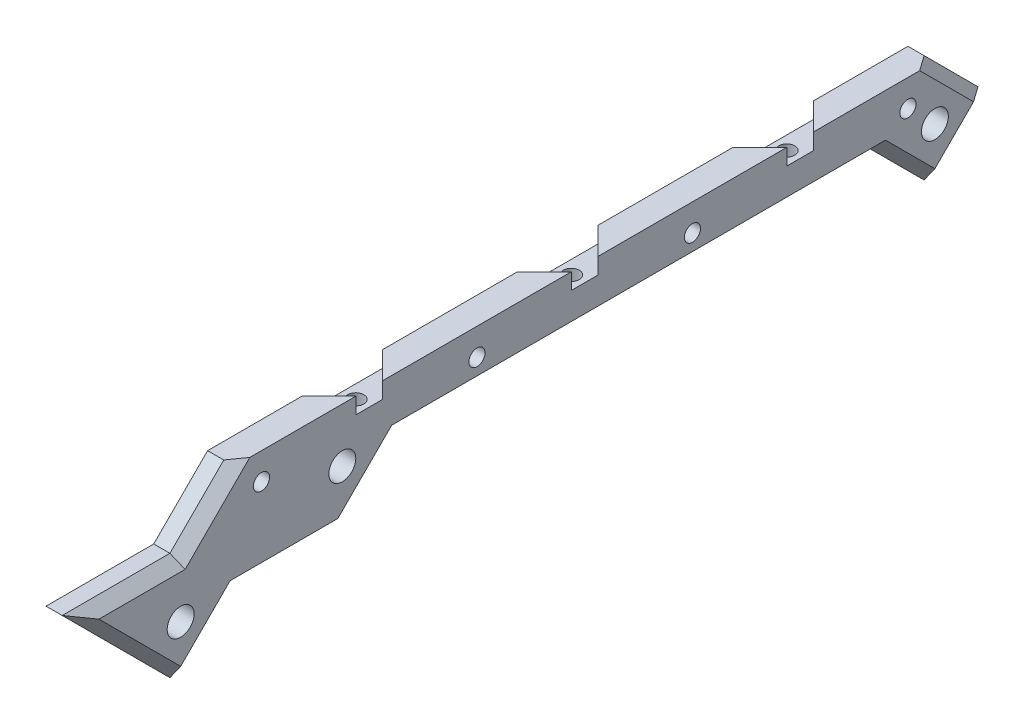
ISO-10303-21;
HEADER;
FILE_DESCRIPTION(('STEP AP214'),'2;1');
FILE_NAME('part.step','',(''),(''),'','','');
FILE_SCHEMA(('AUTOMOTIVE_DESIGN { 1 0 10303 214 1 1 1 1 }'));
ENDSEC;
DATA;
#1=APPLICATION_CONTEXT('core data for automotive mechanical design processes');
#2=APPLICATION_PROTOCOL_DEFINITION('international standard','automotive_design',2000,#1);
#3=PRODUCT_CONTEXT('',#1,'mechanical');
#4=PRODUCT('Part','Part','',(#3));
#5=PRODUCT_RELATED_PRODUCT_CATEGORY('part','',(#4));
#6=PRODUCT_DEFINITION_FORMATION('','',#4);
#7=PRODUCT_DEFINITION_CONTEXT('part definition',#1,'design');
#8=PRODUCT_DEFINITION('design','',#6,#7);
#9=PRODUCT_DEFINITION_SHAPE('','',#8);
#10=(LENGTH_UNIT() NAMED_UNIT(*) SI_UNIT(.MILLI.,.METRE.));
#11=(NAMED_UNIT(*) PLANE_ANGLE_UNIT() SI_UNIT($,.RADIAN.));
#12=(NAMED_UNIT(*) SI_UNIT($,.STERADIAN.) SOLID_ANGLE_UNIT());
#13=UNCERTAINTY_MEASURE_WITH_UNIT(LENGTH_MEASURE(1.E-05),#10,'distance_accuracy_value','');
#14=(GEOMETRIC_REPRESENTATION_CONTEXT(3) GLOBAL_UNCERTAINTY_ASSIGNED_CONTEXT((#13)) GLOBAL_UNIT_ASSIGNED_CONTEXT((#10,
#11,#12)) REPRESENTATION_CONTEXT('',''));
#15=CARTESIAN_POINT('',(0.,0.,0.));
#16=DIRECTION('',(0.,0.,1.));
#17=DIRECTION('',(1.,0.,0.));
#18=AXIS2_PLACEMENT_3D('',#15,#16,#17);
#19=CARTESIAN_POINT('',(5.,9.99999999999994,-64.9999999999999));
#20=DIRECTION('',(0.,-1.,0.));
#21=DIRECTION('',(0.,0.,-1.));
#22=AXIS2_PLACEMENT_3D('',#19,#20,#21);
#23=PLANE('',#22);
#24=DIRECTION('',(0.,0.,1.));
#25=VECTOR('',#24,1.);
#26=CARTESIAN_POINT('',(0.,9.99999999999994,-64.9999999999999));
#27=LINE('',#26,#25);
#28=CARTESIAN_POINT('',(0.,9.99999999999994,-64.9999999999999));
#29=VERTEX_POINT('',#28);
#30=CARTESIAN_POINT('',(0.,9.99999999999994,-47.4999999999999));
#31=VERTEX_POINT('',#30);
#32=EDGE_CURVE('E352',#29,#31,#27,.T.);
#33=ORIENTED_EDGE('',*,*,#32,.T.);
#34=DIRECTION('',(-0.707106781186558,0.,-0.707106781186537));
#35=VECTOR('',#34,1.);
#36=CARTESIAN_POINT('',(0.,9.99999999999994,-47.4999999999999));
#37=LINE('',#36,#35);
#38=CARTESIAN_POINT('',(5.,9.99999999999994,-42.5));
#39=VERTEX_POINT('',#38);
#40=EDGE_CURVE('E503',#39,#31,#37,.T.);
#41=ORIENTED_EDGE('',*,*,#40,.F.);
#42=DIRECTION('',(0.,0.,1.));
#43=VECTOR('',#42,1.);
#44=CARTESIAN_POINT('',(5.,9.99999999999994,-64.9999999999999));
#45=LINE('',#44,#43);
#46=CARTESIAN_POINT('',(5.,9.99999999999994,-62.1715728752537));
#47=VERTEX_POINT('',#46);
#48=EDGE_CURVE('E340',#47,#39,#45,.T.);
#49=ORIENTED_EDGE('',*,*,#48,.F.);
#50=DIRECTION('',(-0.577350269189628,0.,-0.816496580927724));
#51=VECTOR('',#50,1.);
#52=CARTESIAN_POINT('',(17.2969576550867,9.99999999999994,-44.7810485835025));
#53=LINE('',#52,#51);
#54=CARTESIAN_POINT('',(3.00000000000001,9.99999999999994,-64.9999999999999));
#55=VERTEX_POINT('',#54);
#56=EDGE_CURVE('E426',#47,#55,#53,.T.);
#57=ORIENTED_EDGE('',*,*,#56,.T.);
#58=DIRECTION('',(-1.,0.,0.));
#59=VECTOR('',#58,1.);
#60=CARTESIAN_POINT('',(5.,9.99999999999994,-64.9999999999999));
#61=LINE('',#60,#59);
#62=EDGE_CURVE('E398',#55,#29,#61,.T.);
#63=ORIENTED_EDGE('',*,*,#62,.T.);
#64=EDGE_LOOP('',(#33,#41,#49,#57,#63));
#65=FACE_BOUND('',#64,.T.);
#66=ADVANCED_FACE('F40',(#65),#23,.F.);
#67=CARTESIAN_POINT('',(0.,9.99999999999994,7.50000000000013));
#68=VERTEX_POINT('',#67);
#69=CARTESIAN_POINT('',(0.,9.99999999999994,32.5000000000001));
#70=VERTEX_POINT('',#69);
#71=EDGE_CURVE('E767',#68,#70,#27,.T.);
#72=ORIENTED_EDGE('',*,*,#71,.T.);
#73=DIRECTION('',(-0.707106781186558,0.,-0.707106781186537));
#74=VECTOR('',#73,1.);
#75=CARTESIAN_POINT('',(0.,9.99999999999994,32.5000000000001));
#76=LINE('',#75,#74);
#77=CARTESIAN_POINT('',(5.,9.99999999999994,37.5));
#78=VERTEX_POINT('',#77);
#79=EDGE_CURVE('E481',#78,#70,#76,.T.);
#80=ORIENTED_EDGE('',*,*,#79,.F.);
#81=CARTESIAN_POINT('',(5.,9.99999999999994,2.5));
#82=VERTEX_POINT('',#81);
#83=EDGE_CURVE('E635',#82,#78,#45,.T.);
#84=ORIENTED_EDGE('',*,*,#83,.F.);
#85=DIRECTION('',(0.707106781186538,0.,-0.707106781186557));
#86=VECTOR('',#85,1.);
#87=CARTESIAN_POINT('',(5.,9.99999999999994,2.5));
#88=LINE('',#87,#86);
#89=EDGE_CURVE('E486',#68,#82,#88,.T.);
#90=ORIENTED_EDGE('',*,*,#89,.F.);
#91=EDGE_LOOP('',(#72,#80,#84,#90));
#92=FACE_BOUND('',#91,.T.);
#93=ADVANCED_FACE('F601',(#92),#23,.F.);
#94=CARTESIAN_POINT('',(5.,9.99999999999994,-37.5));
#95=VERTEX_POINT('',#94);
#96=CARTESIAN_POINT('',(5.,9.99999999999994,-2.5));
#97=VERTEX_POINT('',#96);
#98=EDGE_CURVE('E344',#95,#97,#45,.T.);
#99=ORIENTED_EDGE('',*,*,#98,.F.);
#100=DIRECTION('',(0.707106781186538,0.,-0.707106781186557));
#101=VECTOR('',#100,1.);
#102=CARTESIAN_POINT('',(5.,9.99999999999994,-37.5));
#103=LINE('',#102,#101);
#104=CARTESIAN_POINT('',(0.,9.99999999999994,-32.4999999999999));
#105=VERTEX_POINT('',#104);
#106=EDGE_CURVE('E480',#105,#95,#103,.T.);
#107=ORIENTED_EDGE('',*,*,#106,.F.);
#108=CARTESIAN_POINT('',(0.,9.99999999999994,-7.49999999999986));
#109=VERTEX_POINT('',#108);
#110=EDGE_CURVE('E356',#105,#109,#27,.T.);
#111=ORIENTED_EDGE('',*,*,#110,.T.);
#112=DIRECTION('',(-0.707106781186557,0.,-0.707106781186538));
#113=VECTOR('',#112,1.);
#114=CARTESIAN_POINT('',(0.,9.99999999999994,-7.49999999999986));
#115=LINE('',#114,#113);
#116=EDGE_CURVE('E520',#97,#109,#115,.T.);
#117=ORIENTED_EDGE('',*,*,#116,.F.);
#118=EDGE_LOOP('',(#99,#107,#111,#117));
#119=FACE_BOUND('',#118,.T.);
#120=ADVANCED_FACE('F576',(#119),#23,.F.);
#121=CARTESIAN_POINT('',(5.,0.,0.));
#122=DIRECTION('',(1.,0.,0.));
#123=DIRECTION('',(0.,0.,-1.));
#124=AXIS2_PLACEMENT_3D('',#121,#122,#123);
#125=PLANE('',#124);
#126=DIRECTION('',(0.,1.,0.));
#127=VECTOR('',#126,1.);
#128=CARTESIAN_POINT('',(5.,6.99999999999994,-42.5));
#129=LINE('',#128,#127);
#130=CARTESIAN_POINT('',(5.,6.99999999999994,-42.5));
#131=VERTEX_POINT('',#130);
#132=EDGE_CURVE('E464',#131,#39,#129,.T.);
#133=ORIENTED_EDGE('',*,*,#132,.F.);
#134=DIRECTION('',(0.,0.,-1.));
#135=VECTOR('',#134,1.);
#136=CARTESIAN_POINT('',(5.,6.99999999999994,-42.5));
#137=LINE('',#136,#135);
#138=CARTESIAN_POINT('',(5.,6.99999999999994,-37.5));
#139=VERTEX_POINT('',#138);
#140=EDGE_CURVE('E509',#139,#131,#137,.T.);
#141=ORIENTED_EDGE('',*,*,#140,.F.);
#142=DIRECTION('',(0.,1.,0.));
#143=VECTOR('',#142,1.);
#144=CARTESIAN_POINT('',(5.,6.99999999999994,-37.5));
#145=LINE('',#144,#143);
#146=EDGE_CURVE('E499',#139,#95,#145,.T.);
#147=ORIENTED_EDGE('',*,*,#146,.T.);
#148=ORIENTED_EDGE('',*,*,#98,.T.);
#149=DIRECTION('',(0.,1.,0.));
#150=VECTOR('',#149,1.);
#151=CARTESIAN_POINT('',(5.,6.99999999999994,-2.5));
#152=LINE('',#151,#150);
#153=CARTESIAN_POINT('',(5.,6.99999999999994,-2.5));
#154=VERTEX_POINT('',#153);
#155=EDGE_CURVE('E535',#154,#97,#152,.T.);
#156=ORIENTED_EDGE('',*,*,#155,.F.);
#157=DIRECTION('',(0.,0.,-1.));
#158=VECTOR('',#157,1.);
#159=CARTESIAN_POINT('',(5.,6.99999999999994,-2.5));
#160=LINE('',#159,#158);
#161=CARTESIAN_POINT('',(5.,6.99999999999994,2.5));
#162=VERTEX_POINT('',#161);
#163=EDGE_CURVE('E523',#162,#154,#160,.T.);
#164=ORIENTED_EDGE('',*,*,#163,.F.);
#165=DIRECTION('',(0.,1.,0.));
#166=VECTOR('',#165,1.);
#167=CARTESIAN_POINT('',(5.,6.99999999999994,2.5));
#168=LINE('',#167,#166);
#169=EDGE_CURVE('E537',#162,#82,#168,.T.);
#170=ORIENTED_EDGE('',*,*,#169,.T.);
#171=ORIENTED_EDGE('',*,*,#83,.T.);
#172=DIRECTION('',(0.,1.,0.));
#173=VECTOR('',#172,1.);
#174=CARTESIAN_POINT('',(5.,6.99999999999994,37.5));
#175=LINE('',#174,#173);
#176=CARTESIAN_POINT('',(5.,6.99999999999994,37.5));
#177=VERTEX_POINT('',#176);
#178=EDGE_CURVE('E475',#177,#78,#175,.T.);
#179=ORIENTED_EDGE('',*,*,#178,.F.);
#180=DIRECTION('',(0.,0.,-1.));
#181=VECTOR('',#180,1.);
#182=CARTESIAN_POINT('',(5.,6.99999999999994,37.5));
#183=LINE('',#182,#181);
#184=CARTESIAN_POINT('',(5.,6.99999999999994,42.5));
#185=VERTEX_POINT('',#184);
#186=EDGE_CURVE('E489',#185,#177,#183,.T.);
#187=ORIENTED_EDGE('',*,*,#186,.F.);
#188=DIRECTION('',(0.,1.,0.));
#189=VECTOR('',#188,1.);
#190=CARTESIAN_POINT('',(5.,6.99999999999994,42.5));
#191=LINE('',#190,#189);
#192=CARTESIAN_POINT('',(5.,9.99999999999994,42.5));
#193=VERTEX_POINT('',#192);
#194=EDGE_CURVE('E472',#185,#193,#191,.T.);
#195=ORIENTED_EDGE('',*,*,#194,.T.);
#196=CARTESIAN_POINT('',(5.,9.99999999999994,62.1715728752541));
#197=VERTEX_POINT('',#196);
#198=EDGE_CURVE('E345',#193,#197,#45,.T.);
#199=ORIENTED_EDGE('',*,*,#198,.T.);
#200=DIRECTION('',(0.,-0.707106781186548,0.707106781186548));
#201=VECTOR('',#200,1.);
#202=CARTESIAN_POINT('',(5.,-1.41421356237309,73.5857864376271));
#203=LINE('',#202,#201);
#204=CARTESIAN_POINT('',(5.,-1.99999999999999,74.171572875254));
#205=VERTEX_POINT('',#204);
#206=EDGE_CURVE('E402',#197,#205,#203,.T.);
#207=ORIENTED_EDGE('',*,*,#206,.T.);
#208=DIRECTION('',(0.,0.,1.));
#209=VECTOR('',#208,1.);
#210=CARTESIAN_POINT('',(5.,-2.,95.0000000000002));
#211=LINE('',#210,#209);
#212=CARTESIAN_POINT('',(5.,-2.,90.171572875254));
#213=VERTEX_POINT('',#212);
#214=EDGE_CURVE('E404',#205,#213,#211,.T.);
#215=ORIENTED_EDGE('',*,*,#214,.T.);
#216=DIRECTION('',(0.,-0.707106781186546,-0.707106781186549));
#217=VECTOR('',#216,1.);
#218=CARTESIAN_POINT('',(5.,-18.5857864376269,73.5857864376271));
#219=LINE('',#218,#217);
#220=CARTESIAN_POINT('',(5.,-17.1715728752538,75.0000000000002));
#221=VERTEX_POINT('',#220);
#222=EDGE_CURVE('E406',#213,#221,#219,.T.);
#223=ORIENTED_EDGE('',*,*,#222,.T.);
#224=DIRECTION('',(0.,0.707106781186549,-0.707106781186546));
#225=VECTOR('',#224,1.);
#226=CARTESIAN_POINT('',(5.,-8.58578643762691,66.4142135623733));
#227=LINE('',#226,#225);
#228=CARTESIAN_POINT('',(5.,-8.00000000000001,65.8284271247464));
#229=VERTEX_POINT('',#228);
#230=EDGE_CURVE('E408',#221,#229,#227,.T.);
#231=ORIENTED_EDGE('',*,*,#230,.T.);
#232=DIRECTION('',(0.,0.,-1.));
#233=VECTOR('',#232,1.);
#234=CARTESIAN_POINT('',(5.,-8.00000000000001,45.0000000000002));
#235=LINE('',#234,#233);
#236=CARTESIAN_POINT('',(5.,-8.00000000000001,45.8284271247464));
#237=VERTEX_POINT('',#236);
#238=EDGE_CURVE('E410',#229,#237,#235,.T.);
#239=ORIENTED_EDGE('',*,*,#238,.T.);
#240=DIRECTION('',(0.,0.707106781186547,-0.707106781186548));
#241=VECTOR('',#240,1.);
#242=CARTESIAN_POINT('',(5.,1.4142135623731,36.4142135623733));
#243=LINE('',#242,#241);
#244=CARTESIAN_POINT('',(5.,1.99999999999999,35.8284271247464));
#245=VERTEX_POINT('',#244);
#246=EDGE_CURVE('E412',#237,#245,#243,.T.);
#247=ORIENTED_EDGE('',*,*,#246,.T.);
#248=DIRECTION('',(0.,0.,-1.));
#249=VECTOR('',#248,1.);
#250=CARTESIAN_POINT('',(5.,1.99999999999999,-54.9999999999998));
#251=LINE('',#250,#249);
#252=CARTESIAN_POINT('',(5.,1.99999999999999,-55.828427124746));
#253=VERTEX_POINT('',#252);
#254=EDGE_CURVE('E414',#245,#253,#251,.T.);
#255=ORIENTED_EDGE('',*,*,#254,.T.);
#256=DIRECTION('',(0.,-0.707106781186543,-0.707106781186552));
#257=VECTOR('',#256,1.);
#258=CARTESIAN_POINT('',(5.,-8.58578643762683,-66.414213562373));
#259=LINE('',#258,#257);
#260=CARTESIAN_POINT('',(5.,-7.17157287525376,-64.9999999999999));
#261=VERTEX_POINT('',#260);
#262=EDGE_CURVE('E416',#253,#261,#259,.T.);
#263=ORIENTED_EDGE('',*,*,#262,.T.);
#264=DIRECTION('',(0.,0.707106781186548,-0.707106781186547));
#265=VECTOR('',#264,1.);
#266=CARTESIAN_POINT('',(5.,1.41421356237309,-73.5857864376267));
#267=LINE('',#266,#265);
#268=CARTESIAN_POINT('',(5.,0.,-72.1715728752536));
#269=VERTEX_POINT('',#268);
#270=EDGE_CURVE('E418',#261,#269,#267,.T.);
#271=ORIENTED_EDGE('',*,*,#270,.T.);
#272=DIRECTION('',(0.,0.707106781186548,0.707106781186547));
#273=VECTOR('',#272,1.);
#274=CARTESIAN_POINT('',(5.,8.58578643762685,-63.5857864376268));
#275=LINE('',#274,#273);
#276=EDGE_CURVE('E420',#269,#47,#275,.T.);
#277=ORIENTED_EDGE('',*,*,#276,.T.);
#278=ORIENTED_EDGE('',*,*,#48,.T.);
#279=EDGE_LOOP('',(#133,#141,#147,#148,#156,#164,#170,#171,#179,#187,#195,#199,#207,#215,#223,
#231,#239,#247,#255,#263,#271,#277,#278));
#280=FACE_BOUND('',#279,.T.);
#281=CARTESIAN_POINT('',(5.,4.99999999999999,60.0000000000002));
#282=DIRECTION('',(1.,0.,0.));
#283=DIRECTION('',(0.,0.,-1.));
#284=AXIS2_PLACEMENT_3D('',#281,#282,#283);
#285=CIRCLE('',#284,1.5);
#286=CARTESIAN_POINT('',(5.,4.99999999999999,58.5000000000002));
#287=VERTEX_POINT('',#286);
#288=EDGE_CURVE('E543',#287,#287,#285,.T.);
#289=ORIENTED_EDGE('',*,*,#288,.F.);
#290=EDGE_LOOP('',(#289));
#291=FACE_BOUND('',#290,.T.);
#292=CARTESIAN_POINT('',(5.,4.99999999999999,-20.0000000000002));
#293=DIRECTION('',(1.,0.,0.));
#294=DIRECTION('',(0.,0.,-1.));
#295=AXIS2_PLACEMENT_3D('',#292,#293,#294);
#296=CIRCLE('',#295,1.5);
#297=CARTESIAN_POINT('',(5.,4.99999999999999,-21.5000000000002));
#298=VERTEX_POINT('',#297);
#299=EDGE_CURVE('E547',#298,#298,#296,.T.);
#300=ORIENTED_EDGE('',*,*,#299,.F.);
#301=EDGE_LOOP('',(#300));
#302=FACE_BOUND('',#301,.T.);
#303=CARTESIAN_POINT('',(5.,4.99999999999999,20.0000000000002));
#304=DIRECTION('',(1.,0.,0.));
#305=DIRECTION('',(0.,0.,-1.));
#306=AXIS2_PLACEMENT_3D('',#303,#304,#305);
#307=CIRCLE('',#306,1.5);
#308=CARTESIAN_POINT('',(5.,4.99999999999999,18.5000000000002));
#309=VERTEX_POINT('',#308);
#310=EDGE_CURVE('E558',#309,#309,#307,.T.);
#311=ORIENTED_EDGE('',*,*,#310,.F.);
#312=EDGE_LOOP('',(#311));
#313=FACE_BOUND('',#312,.T.);
#314=CARTESIAN_POINT('',(5.,4.99999999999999,-60.0000000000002));
#315=DIRECTION('',(1.,0.,0.));
#316=DIRECTION('',(0.,0.,-1.));
#317=AXIS2_PLACEMENT_3D('',#314,#315,#316);
#318=CIRCLE('',#317,1.5);
#319=CARTESIAN_POINT('',(5.,4.99999999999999,-61.5000000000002));
#320=VERTEX_POINT('',#319);
#321=EDGE_CURVE('E546',#320,#320,#318,.T.);
#322=ORIENTED_EDGE('',*,*,#321,.F.);
#323=EDGE_LOOP('',(#322));
#324=FACE_BOUND('',#323,.T.);
#325=CARTESIAN_POINT('',(5.,0.,45.0000000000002));
#326=DIRECTION('',(1.,0.,0.));
#327=DIRECTION('',(0.,0.,-1.));
#328=AXIS2_PLACEMENT_3D('',#325,#326,#327);
#329=CIRCLE('',#328,2.5);
#330=CARTESIAN_POINT('',(5.,0.,42.5000000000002));
#331=VERTEX_POINT('',#330);
#332=EDGE_CURVE('E328',#331,#331,#329,.T.);
#333=ORIENTED_EDGE('',*,*,#332,.F.);
#334=EDGE_LOOP('',(#333));
#335=FACE_BOUND('',#334,.T.);
#336=CARTESIAN_POINT('',(5.,-10.,75.0000000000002));
#337=DIRECTION('',(1.,0.,0.));
#338=DIRECTION('',(0.,0.,-1.));
#339=AXIS2_PLACEMENT_3D('',#336,#337,#338);
#340=CIRCLE('',#339,2.49999999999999);
#341=CARTESIAN_POINT('',(5.,-10.,72.5000000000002));
#342=VERTEX_POINT('',#341);
#343=EDGE_CURVE('E334',#342,#342,#340,.T.);
#344=ORIENTED_EDGE('',*,*,#343,.F.);
#345=EDGE_LOOP('',(#344));
#346=FACE_BOUND('',#345,.T.);
#347=CARTESIAN_POINT('',(5.,0.,-64.9999999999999));
#348=DIRECTION('',(1.,0.,0.));
#349=DIRECTION('',(0.,0.,-1.));
#350=AXIS2_PLACEMENT_3D('',#347,#348,#349);
#351=CIRCLE('',#350,2.49999999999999);
#352=CARTESIAN_POINT('',(5.,0.,-67.4999999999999));
#353=VERTEX_POINT('',#352);
#354=EDGE_CURVE('E319',#353,#353,#351,.T.);
#355=ORIENTED_EDGE('',*,*,#354,.F.);
#356=EDGE_LOOP('',(#355));
#357=FACE_BOUND('',#356,.T.);
#358=ADVANCED_FACE('F448',(#280,#291,#302,#313,#324,#335,#346,#357),#125,.T.);
#359=CARTESIAN_POINT('',(0.,0.,0.));
#360=DIRECTION('',(1.,0.,0.));
#361=DIRECTION('',(0.,0.,-1.));
#362=AXIS2_PLACEMENT_3D('',#359,#360,#361);
#363=PLANE('',#362);
#364=CARTESIAN_POINT('',(0.,4.99999999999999,60.0000000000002));
#365=DIRECTION('',(1.,0.,0.));
#366=DIRECTION('',(0.,0.,-1.));
#367=AXIS2_PLACEMENT_3D('',#364,#365,#366);
#368=CIRCLE('',#367,1.5);
#369=CARTESIAN_POINT('',(0.,4.99999999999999,58.5000000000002));
#370=VERTEX_POINT('',#369);
#371=EDGE_CURVE('E289',#370,#370,#368,.T.);
#372=ORIENTED_EDGE('',*,*,#371,.T.);
#373=EDGE_LOOP('',(#372));
#374=FACE_BOUND('',#373,.T.);
#375=CARTESIAN_POINT('',(0.,4.99999999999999,-20.0000000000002));
#376=DIRECTION('',(1.,0.,0.));
#377=DIRECTION('',(0.,0.,-1.));
#378=AXIS2_PLACEMENT_3D('',#375,#376,#377);
#379=CIRCLE('',#378,1.5);
#380=CARTESIAN_POINT('',(0.,4.99999999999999,-21.5000000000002));
#381=VERTEX_POINT('',#380);
#382=EDGE_CURVE('E534',#381,#381,#379,.T.);
#383=ORIENTED_EDGE('',*,*,#382,.T.);
#384=EDGE_LOOP('',(#383));
#385=FACE_BOUND('',#384,.T.);
#386=CARTESIAN_POINT('',(0.,4.99999999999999,20.0000000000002));
#387=DIRECTION('',(1.,0.,0.));
#388=DIRECTION('',(0.,0.,-1.));
#389=AXIS2_PLACEMENT_3D('',#386,#387,#388);
#390=CIRCLE('',#389,1.5);
#391=CARTESIAN_POINT('',(0.,4.99999999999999,18.5000000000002));
#392=VERTEX_POINT('',#391);
#393=EDGE_CURVE('E550',#392,#392,#390,.T.);
#394=ORIENTED_EDGE('',*,*,#393,.T.);
#395=EDGE_LOOP('',(#394));
#396=FACE_BOUND('',#395,.T.);
#397=CARTESIAN_POINT('',(0.,4.99999999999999,-60.0000000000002));
#398=DIRECTION('',(1.,0.,0.));
#399=DIRECTION('',(0.,0.,-1.));
#400=AXIS2_PLACEMENT_3D('',#397,#398,#399);
#401=CIRCLE('',#400,1.5);
#402=CARTESIAN_POINT('',(0.,4.99999999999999,-61.5000000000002));
#403=VERTEX_POINT('',#402);
#404=EDGE_CURVE('E555',#403,#403,#401,.T.);
#405=ORIENTED_EDGE('',*,*,#404,.T.);
#406=EDGE_LOOP('',(#405));
#407=FACE_BOUND('',#406,.T.);
#408=DIRECTION('',(0.,0.,1.));
#409=VECTOR('',#408,1.);
#410=CARTESIAN_POINT('',(0.,6.99999999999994,-32.4999999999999));
#411=LINE('',#410,#409);
#412=CARTESIAN_POINT('',(0.,6.99999999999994,-47.4999999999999));
#413=VERTEX_POINT('',#412);
#414=CARTESIAN_POINT('',(0.,6.99999999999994,-32.4999999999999));
#415=VERTEX_POINT('',#414);
#416=EDGE_CURVE('E505',#413,#415,#411,.T.);
#417=ORIENTED_EDGE('',*,*,#416,.F.);
#418=DIRECTION('',(0.,1.,0.));
#419=VECTOR('',#418,1.);
#420=CARTESIAN_POINT('',(0.,6.99999999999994,-47.4999999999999));
#421=LINE('',#420,#419);
#422=EDGE_CURVE('E461',#413,#31,#421,.T.);
#423=ORIENTED_EDGE('',*,*,#422,.T.);
#424=ORIENTED_EDGE('',*,*,#32,.F.);
#425=DIRECTION('',(0.,0.707106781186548,0.707106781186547));
#426=VECTOR('',#425,1.);
#427=CARTESIAN_POINT('',(0.,0.,-74.9999999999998));
#428=LINE('',#427,#426);
#429=CARTESIAN_POINT('',(0.,0.,-74.9999999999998));
#430=VERTEX_POINT('',#429);
#431=EDGE_CURVE('E348',#430,#29,#428,.T.);
#432=ORIENTED_EDGE('',*,*,#431,.F.);
#433=DIRECTION('',(0.,0.707106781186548,-0.707106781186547));
#434=VECTOR('',#433,1.);
#435=CARTESIAN_POINT('',(0.,0.,-74.9999999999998));
#436=LINE('',#435,#434);
#437=CARTESIAN_POINT('',(0.,-9.99999999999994,-64.9999999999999));
#438=VERTEX_POINT('',#437);
#439=EDGE_CURVE('E337',#438,#430,#436,.T.);
#440=ORIENTED_EDGE('',*,*,#439,.F.);
#441=DIRECTION('',(0.,-0.707106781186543,-0.707106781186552));
#442=VECTOR('',#441,1.);
#443=CARTESIAN_POINT('',(0.,0.,-54.9999999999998));
#444=LINE('',#443,#442);
#445=CARTESIAN_POINT('',(0.,0.,-54.9999999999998));
#446=VERTEX_POINT('',#445);
#447=EDGE_CURVE('E377',#446,#438,#444,.T.);
#448=ORIENTED_EDGE('',*,*,#447,.F.);
#449=DIRECTION('',(0.,0.,-1.));
#450=VECTOR('',#449,1.);
#451=CARTESIAN_POINT('',(0.,0.,-54.9999999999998));
#452=LINE('',#451,#450);
#453=CARTESIAN_POINT('',(0.,0.,35.0000000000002));
#454=VERTEX_POINT('',#453);
#455=EDGE_CURVE('E374',#454,#446,#452,.T.);
#456=ORIENTED_EDGE('',*,*,#455,.F.);
#457=DIRECTION('',(0.,0.707106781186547,-0.707106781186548));
#458=VECTOR('',#457,1.);
#459=CARTESIAN_POINT('',(0.,-10.,45.0000000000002));
#460=LINE('',#459,#458);
#461=CARTESIAN_POINT('',(0.,-10.,45.0000000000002));
#462=VERTEX_POINT('',#461);
#463=EDGE_CURVE('E371',#462,#454,#460,.T.);
#464=ORIENTED_EDGE('',*,*,#463,.F.);
#465=DIRECTION('',(0.,0.,-1.));
#466=VECTOR('',#465,1.);
#467=CARTESIAN_POINT('',(0.,-10.,65.0000000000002));
#468=LINE('',#467,#466);
#469=CARTESIAN_POINT('',(0.,-10.,65.0000000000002));
#470=VERTEX_POINT('',#469);
#471=EDGE_CURVE('E368',#470,#462,#468,.T.);
#472=ORIENTED_EDGE('',*,*,#471,.F.);
#473=DIRECTION('',(0.,0.707106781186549,-0.707106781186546));
#474=VECTOR('',#473,1.);
#475=CARTESIAN_POINT('',(0.,-20.,75.0000000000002));
#476=LINE('',#475,#474);
#477=CARTESIAN_POINT('',(0.,-20.,75.0000000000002));
#478=VERTEX_POINT('',#477);
#479=EDGE_CURVE('E365',#478,#470,#476,.T.);
#480=ORIENTED_EDGE('',*,*,#479,.F.);
#481=DIRECTION('',(0.,-0.707106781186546,-0.707106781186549));
#482=VECTOR('',#481,1.);
#483=CARTESIAN_POINT('',(0.,0.,95.0000000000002));
#484=LINE('',#483,#482);
#485=CARTESIAN_POINT('',(0.,0.,95.0000000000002));
#486=VERTEX_POINT('',#485);
#487=EDGE_CURVE('E362',#486,#478,#484,.T.);
#488=ORIENTED_EDGE('',*,*,#487,.F.);
#489=DIRECTION('',(0.,0.,1.));
#490=VECTOR('',#489,1.);
#491=CARTESIAN_POINT('',(0.,0.,75.0000000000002));
#492=LINE('',#491,#490);
#493=CARTESIAN_POINT('',(0.,0.,75.0000000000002));
#494=VERTEX_POINT('',#493);
#495=EDGE_CURVE('E359',#494,#486,#492,.T.);
#496=ORIENTED_EDGE('',*,*,#495,.F.);
#497=DIRECTION('',(0.,-0.707106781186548,0.707106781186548));
#498=VECTOR('',#497,1.);
#499=CARTESIAN_POINT('',(0.,9.99999999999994,65.0000000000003));
#500=LINE('',#499,#498);
#501=CARTESIAN_POINT('',(0.,9.99999999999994,65.0000000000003));
#502=VERTEX_POINT('',#501);
#503=EDGE_CURVE('E355',#502,#494,#500,.T.);
#504=ORIENTED_EDGE('',*,*,#503,.F.);
#505=CARTESIAN_POINT('',(0.,9.99999999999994,47.5000000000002));
#506=VERTEX_POINT('',#505);
#507=EDGE_CURVE('E351',#506,#502,#27,.T.);
#508=ORIENTED_EDGE('',*,*,#507,.F.);
#509=DIRECTION('',(0.,1.,0.));
#510=VECTOR('',#509,1.);
#511=CARTESIAN_POINT('',(0.,6.99999999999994,47.5000000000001));
#512=LINE('',#511,#510);
#513=CARTESIAN_POINT('',(0.,6.99999999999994,47.5000000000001));
#514=VERTEX_POINT('',#513);
#515=EDGE_CURVE('E469',#514,#506,#512,.T.);
#516=ORIENTED_EDGE('',*,*,#515,.F.);
#517=DIRECTION('',(0.,0.,1.));
#518=VECTOR('',#517,1.);
#519=CARTESIAN_POINT('',(0.,6.99999999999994,47.5000000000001));
#520=LINE('',#519,#518);
#521=CARTESIAN_POINT('',(0.,6.99999999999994,32.5000000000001));
#522=VERTEX_POINT('',#521);
#523=EDGE_CURVE('E484',#522,#514,#520,.T.);
#524=ORIENTED_EDGE('',*,*,#523,.F.);
#525=DIRECTION('',(0.,1.,0.));
#526=VECTOR('',#525,1.);
#527=CARTESIAN_POINT('',(0.,6.99999999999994,32.5000000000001));
#528=LINE('',#527,#526);
#529=EDGE_CURVE('E477',#522,#70,#528,.T.);
#530=ORIENTED_EDGE('',*,*,#529,.T.);
#531=ORIENTED_EDGE('',*,*,#71,.F.);
#532=DIRECTION('',(0.,1.,0.));
#533=VECTOR('',#532,1.);
#534=CARTESIAN_POINT('',(0.,6.99999999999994,7.50000000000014));
#535=LINE('',#534,#533);
#536=CARTESIAN_POINT('',(0.,6.99999999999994,7.50000000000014));
#537=VERTEX_POINT('',#536);
#538=EDGE_CURVE('E528',#537,#68,#535,.T.);
#539=ORIENTED_EDGE('',*,*,#538,.F.);
#540=DIRECTION('',(0.,0.,1.));
#541=VECTOR('',#540,1.);
#542=CARTESIAN_POINT('',(0.,6.99999999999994,7.50000000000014));
#543=LINE('',#542,#541);
#544=CARTESIAN_POINT('',(0.,6.99999999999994,-7.49999999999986));
#545=VERTEX_POINT('',#544);
#546=EDGE_CURVE('E516',#545,#537,#543,.T.);
#547=ORIENTED_EDGE('',*,*,#546,.F.);
#548=DIRECTION('',(0.,1.,0.));
#549=VECTOR('',#548,1.);
#550=CARTESIAN_POINT('',(0.,6.99999999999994,-7.49999999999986));
#551=LINE('',#550,#549);
#552=EDGE_CURVE('E531',#545,#109,#551,.T.);
#553=ORIENTED_EDGE('',*,*,#552,.T.);
#554=ORIENTED_EDGE('',*,*,#110,.F.);
#555=DIRECTION('',(0.,1.,0.));
#556=VECTOR('',#555,1.);
#557=CARTESIAN_POINT('',(0.,6.99999999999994,-32.4999999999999));
#558=LINE('',#557,#556);
#559=EDGE_CURVE('E496',#415,#105,#558,.T.);
#560=ORIENTED_EDGE('',*,*,#559,.F.);
#561=EDGE_LOOP('',(#417,#423,#424,#432,#440,#448,#456,#464,#472,#480,#488,#496,#504,#508,#516,
#524,#530,#531,#539,#547,#553,#554,#560));
#562=FACE_BOUND('',#561,.T.);
#563=CARTESIAN_POINT('',(0.,-10.,75.0000000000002));
#564=DIRECTION('',(1.,0.,0.));
#565=DIRECTION('',(0.,0.,-1.));
#566=AXIS2_PLACEMENT_3D('',#563,#564,#565);
#567=CIRCLE('',#566,2.49999999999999);
#568=CARTESIAN_POINT('',(0.,-10.,72.5000000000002));
#569=VERTEX_POINT('',#568);
#570=EDGE_CURVE('E331',#569,#569,#567,.T.);
#571=ORIENTED_EDGE('',*,*,#570,.T.);
#572=EDGE_LOOP('',(#571));
#573=FACE_BOUND('',#572,.T.);
#574=CARTESIAN_POINT('',(0.,0.,45.0000000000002));
#575=DIRECTION('',(1.,0.,0.));
#576=DIRECTION('',(0.,0.,-1.));
#577=AXIS2_PLACEMENT_3D('',#574,#575,#576);
#578=CIRCLE('',#577,2.5);
#579=CARTESIAN_POINT('',(0.,0.,42.5000000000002));
#580=VERTEX_POINT('',#579);
#581=EDGE_CURVE('E324',#580,#580,#578,.T.);
#582=ORIENTED_EDGE('',*,*,#581,.T.);
#583=EDGE_LOOP('',(#582));
#584=FACE_BOUND('',#583,.T.);
#585=CARTESIAN_POINT('',(0.,0.,-64.9999999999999));
#586=DIRECTION('',(1.,0.,0.));
#587=DIRECTION('',(0.,0.,-1.));
#588=AXIS2_PLACEMENT_3D('',#585,#586,#587);
#589=CIRCLE('',#588,2.49999999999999);
#590=CARTESIAN_POINT('',(0.,0.,-67.4999999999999));
#591=VERTEX_POINT('',#590);
#592=EDGE_CURVE('E313',#591,#591,#589,.T.);
#593=ORIENTED_EDGE('',*,*,#592,.T.);
#594=EDGE_LOOP('',(#593));
#595=FACE_BOUND('',#594,.T.);
#596=ADVANCED_FACE('F563',(#374,#385,#396,#407,#562,#573,#584,#595),#363,.F.);
#597=CARTESIAN_POINT('',(5.,0.,-74.9999999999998));
#598=DIRECTION('',(0.,0.707106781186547,0.707106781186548));
#599=DIRECTION('',(0.,-0.707106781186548,0.707106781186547));
#600=AXIS2_PLACEMENT_3D('',#597,#598,#599);
#601=PLANE('',#600);
#602=DIRECTION('',(-1.,0.,0.));
#603=VECTOR('',#602,1.);
#604=CARTESIAN_POINT('',(5.,0.,-74.9999999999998));
#605=LINE('',#604,#603);
#606=CARTESIAN_POINT('',(3.,0.,-74.9999999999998));
#607=VERTEX_POINT('',#606);
#608=EDGE_CURVE('E400',#607,#430,#605,.T.);
#609=ORIENTED_EDGE('',*,*,#608,.F.);
#610=DIRECTION('',(0.,-0.707106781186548,0.707106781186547));
#611=VECTOR('',#610,1.);
#612=CARTESIAN_POINT('',(3.,-9.99999999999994,-64.9999999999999));
#613=LINE('',#612,#611);
#614=CARTESIAN_POINT('',(3.,-9.99999999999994,-64.9999999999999));
#615=VERTEX_POINT('',#614);
#616=EDGE_CURVE('E429',#607,#615,#613,.T.);
#617=ORIENTED_EDGE('',*,*,#616,.T.);
#618=DIRECTION('',(-1.,0.,0.));
#619=VECTOR('',#618,1.);
#620=CARTESIAN_POINT('',(5.,-9.99999999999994,-64.9999999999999));
#621=LINE('',#620,#619);
#622=EDGE_CURVE('E343',#615,#438,#621,.T.);
#623=ORIENTED_EDGE('',*,*,#622,.T.);
#624=ORIENTED_EDGE('',*,*,#439,.T.);
#625=EDGE_LOOP('',(#609,#617,#623,#624));
#626=FACE_BOUND('',#625,.T.);
#627=ADVANCED_FACE('F621',(#626),#601,.F.);
#628=CARTESIAN_POINT('',(5.,0.,-74.9999999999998));
#629=DIRECTION('',(0.,-0.707106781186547,0.707106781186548));
#630=DIRECTION('',(0.,-0.707106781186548,-0.707106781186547));
#631=AXIS2_PLACEMENT_3D('',#628,#629,#630);
#632=PLANE('',#631);
#633=ORIENTED_EDGE('',*,*,#62,.F.);
#634=DIRECTION('',(0.,-0.707106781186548,-0.707106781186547));
#635=VECTOR('',#634,1.);
#636=CARTESIAN_POINT('',(3.00000000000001,0.,-74.9999999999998));
#637=LINE('',#636,#635);
#638=EDGE_CURVE('E428',#55,#607,#637,.T.);
#639=ORIENTED_EDGE('',*,*,#638,.T.);
#640=ORIENTED_EDGE('',*,*,#608,.T.);
#641=ORIENTED_EDGE('',*,*,#431,.T.);
#642=EDGE_LOOP('',(#633,#639,#640,#641));
#643=FACE_BOUND('',#642,.T.);
#644=ADVANCED_FACE('F613',(#643),#632,.F.);
#645=ORIENTED_EDGE('',*,*,#198,.F.);
#646=DIRECTION('',(0.707106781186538,0.,-0.707106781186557));
#647=VECTOR('',#646,1.);
#648=CARTESIAN_POINT('',(5.,9.99999999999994,42.5));
#649=LINE('',#648,#647);
#650=EDGE_CURVE('E483',#506,#193,#649,.T.);
#651=ORIENTED_EDGE('',*,*,#650,.F.);
#652=ORIENTED_EDGE('',*,*,#507,.T.);
#653=DIRECTION('',(-1.,0.,0.));
#654=VECTOR('',#653,1.);
#655=CARTESIAN_POINT('',(5.,9.99999999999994,65.0000000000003));
#656=LINE('',#655,#654);
#657=CARTESIAN_POINT('',(3.,9.99999999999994,65.0000000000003));
#658=VERTEX_POINT('',#657);
#659=EDGE_CURVE('E395',#658,#502,#656,.T.);
#660=ORIENTED_EDGE('',*,*,#659,.F.);
#661=DIRECTION('',(0.577350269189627,0.,-0.816496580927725));
#662=VECTOR('',#661,1.);
#663=CARTESIAN_POINT('',(17.2969576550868,9.99999999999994,44.7810485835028));
#664=LINE('',#663,#662);
#665=EDGE_CURVE('E423',#658,#197,#664,.T.);
#666=ORIENTED_EDGE('',*,*,#665,.T.);
#667=EDGE_LOOP('',(#645,#651,#652,#660,#666));
#668=FACE_BOUND('',#667,.T.);
#669=ADVANCED_FACE('F604',(#668),#23,.F.);
#670=CARTESIAN_POINT('',(5.,9.99999999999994,65.0000000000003));
#671=DIRECTION('',(0.,-0.707106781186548,-0.707106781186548));
#672=DIRECTION('',(0.,0.707106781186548,-0.707106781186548));
#673=AXIS2_PLACEMENT_3D('',#670,#671,#672);
#674=PLANE('',#673);
#675=DIRECTION('',(-1.,0.,0.));
#676=VECTOR('',#675,1.);
#677=CARTESIAN_POINT('',(5.,0.,75.0000000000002));
#678=LINE('',#677,#676);
#679=CARTESIAN_POINT('',(3.,0.,75.0000000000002));
#680=VERTEX_POINT('',#679);
#681=EDGE_CURVE('E393',#680,#494,#678,.T.);
#682=ORIENTED_EDGE('',*,*,#681,.F.);
#683=DIRECTION('',(0.,0.707106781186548,-0.707106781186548));
#684=VECTOR('',#683,1.);
#685=CARTESIAN_POINT('',(3.,9.99999999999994,65.0000000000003));
#686=LINE('',#685,#684);
#687=EDGE_CURVE('E11',#680,#658,#686,.T.);
#688=ORIENTED_EDGE('',*,*,#687,.T.);
#689=ORIENTED_EDGE('',*,*,#659,.T.);
#690=ORIENTED_EDGE('',*,*,#503,.T.);
#691=EDGE_LOOP('',(#682,#688,#689,#690));
#692=FACE_BOUND('',#691,.T.);
#693=ADVANCED_FACE('F612',(#692),#674,.F.);
#694=CARTESIAN_POINT('',(5.,0.,75.0000000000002));
#695=DIRECTION('',(0.,-1.,0.));
#696=DIRECTION('',(0.,0.,-1.));
#697=AXIS2_PLACEMENT_3D('',#694,#695,#696);
#698=PLANE('',#697);
#699=DIRECTION('',(-1.,0.,0.));
#700=VECTOR('',#699,1.);
#701=CARTESIAN_POINT('',(5.,0.,95.0000000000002));
#702=LINE('',#701,#700);
#703=CARTESIAN_POINT('',(3.,0.,95.0000000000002));
#704=VERTEX_POINT('',#703);
#705=EDGE_CURVE('E391',#704,#486,#702,.T.);
#706=ORIENTED_EDGE('',*,*,#705,.F.);
#707=DIRECTION('',(0.,0.,-1.));
#708=VECTOR('',#707,1.);
#709=CARTESIAN_POINT('',(3.,0.,75.0000000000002));
#710=LINE('',#709,#708);
#711=EDGE_CURVE('E50',#704,#680,#710,.T.);
#712=ORIENTED_EDGE('',*,*,#711,.T.);
#713=ORIENTED_EDGE('',*,*,#681,.T.);
#714=ORIENTED_EDGE('',*,*,#495,.T.);
#715=EDGE_LOOP('',(#706,#712,#713,#714));
#716=FACE_BOUND('',#715,.T.);
#717=ADVANCED_FACE('F619',(#716),#698,.F.);
#718=CARTESIAN_POINT('',(5.,0.,95.0000000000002));
#719=DIRECTION('',(0.,0.707106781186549,-0.707106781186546));
#720=DIRECTION('',(0.,0.707106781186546,0.707106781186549));
#721=AXIS2_PLACEMENT_3D('',#718,#719,#720);
#722=PLANE('',#721);
#723=DIRECTION('',(-1.,0.,0.));
#724=VECTOR('',#723,1.);
#725=CARTESIAN_POINT('',(5.,-20.,75.0000000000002));
#726=LINE('',#725,#724);
#727=CARTESIAN_POINT('',(3.,-20.,75.0000000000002));
#728=VERTEX_POINT('',#727);
#729=EDGE_CURVE('E389',#728,#478,#726,.T.);
#730=ORIENTED_EDGE('',*,*,#729,.F.);
#731=DIRECTION('',(0.,0.707106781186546,0.707106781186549));
#732=VECTOR('',#731,1.);
#733=CARTESIAN_POINT('',(3.,0.,95.0000000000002));
#734=LINE('',#733,#732);
#735=EDGE_CURVE('E282',#728,#704,#734,.T.);
#736=ORIENTED_EDGE('',*,*,#735,.T.);
#737=ORIENTED_EDGE('',*,*,#705,.T.);
#738=ORIENTED_EDGE('',*,*,#487,.T.);
#739=EDGE_LOOP('',(#730,#736,#737,#738));
#740=FACE_BOUND('',#739,.T.);
#741=ADVANCED_FACE('F749',(#740),#722,.F.);
#742=CARTESIAN_POINT('',(5.,-20.,75.0000000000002));
#743=DIRECTION('',(0.,0.707106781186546,0.707106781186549));
#744=DIRECTION('',(0.,-0.707106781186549,0.707106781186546));
#745=AXIS2_PLACEMENT_3D('',#742,#743,#744);
#746=PLANE('',#745);
#747=DIRECTION('',(-1.,0.,0.));
#748=VECTOR('',#747,1.);
#749=CARTESIAN_POINT('',(5.,-10.,65.0000000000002));
#750=LINE('',#749,#748);
#751=CARTESIAN_POINT('',(3.,-10.,65.0000000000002));
#752=VERTEX_POINT('',#751);
#753=EDGE_CURVE('E387',#752,#470,#750,.T.);
#754=ORIENTED_EDGE('',*,*,#753,.F.);
#755=DIRECTION('',(0.,-0.707106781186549,0.707106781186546));
#756=VECTOR('',#755,1.);
#757=CARTESIAN_POINT('',(3.,-20.,75.0000000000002));
#758=LINE('',#757,#756);
#759=EDGE_CURVE('E280',#752,#728,#758,.T.);
#760=ORIENTED_EDGE('',*,*,#759,.T.);
#761=ORIENTED_EDGE('',*,*,#729,.T.);
#762=ORIENTED_EDGE('',*,*,#479,.T.);
#763=EDGE_LOOP('',(#754,#760,#761,#762));
#764=FACE_BOUND('',#763,.T.);
#765=ADVANCED_FACE('F746',(#764),#746,.F.);
#766=CARTESIAN_POINT('',(5.,-10.,65.0000000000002));
#767=DIRECTION('',(0.,1.,0.));
#768=DIRECTION('',(0.,0.,1.));
#769=AXIS2_PLACEMENT_3D('',#766,#767,#768);
#770=PLANE('',#769);
#771=DIRECTION('',(-1.,0.,0.));
#772=VECTOR('',#771,1.);
#773=CARTESIAN_POINT('',(5.,-10.,45.0000000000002));
#774=LINE('',#773,#772);
#775=CARTESIAN_POINT('',(3.,-10.,45.0000000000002));
#776=VERTEX_POINT('',#775);
#777=EDGE_CURVE('E385',#776,#462,#774,.T.);
#778=ORIENTED_EDGE('',*,*,#777,.F.);
#779=DIRECTION('',(0.,0.,1.));
#780=VECTOR('',#779,1.);
#781=CARTESIAN_POINT('',(3.,-10.,65.0000000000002));
#782=LINE('',#781,#780);
#783=EDGE_CURVE('E278',#776,#752,#782,.T.);
#784=ORIENTED_EDGE('',*,*,#783,.T.);
#785=ORIENTED_EDGE('',*,*,#753,.T.);
#786=ORIENTED_EDGE('',*,*,#471,.T.);
#787=EDGE_LOOP('',(#778,#784,#785,#786));
#788=FACE_BOUND('',#787,.T.);
#789=ADVANCED_FACE('F659',(#788),#770,.F.);
#790=CARTESIAN_POINT('',(5.,-10.,45.0000000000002));
#791=DIRECTION('',(0.,0.707106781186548,0.707106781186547));
#792=DIRECTION('',(0.,-0.707106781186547,0.707106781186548));
#793=AXIS2_PLACEMENT_3D('',#790,#791,#792);
#794=PLANE('',#793);
#795=DIRECTION('',(0.,-0.707106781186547,0.707106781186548));
#796=VECTOR('',#795,1.);
#797=CARTESIAN_POINT('',(3.,-10.,45.0000000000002));
#798=LINE('',#797,#796);
#799=CARTESIAN_POINT('',(3.,0.,35.0000000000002));
#800=VERTEX_POINT('',#799);
#801=CARTESIAN_POINT('',(3.,-3.58578643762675,38.585786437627));
#802=VERTEX_POINT('',#801);
#803=EDGE_CURVE('E275',#800,#802,#798,.T.);
#804=ORIENTED_EDGE('',*,*,#803,.T.);
#805=CARTESIAN_POINT('',(2.5,-4.99999999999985,40.0000000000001));
#806=DIRECTION('',(0.,0.707106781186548,0.707106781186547));
#807=DIRECTION('',(0.,0.707106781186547,-0.707106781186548));
#808=AXIS2_PLACEMENT_3D('',#805,#806,#807);
#809=ELLIPSE('',#808,2.12132034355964,1.5);
#810=CARTESIAN_POINT('',(3.,-6.41421356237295,41.4142135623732));
#811=VERTEX_POINT('',#810);
#812=EDGE_CURVE('E57',#802,#811,#809,.T.);
#813=ORIENTED_EDGE('',*,*,#812,.T.);
#814=EDGE_CURVE('E270',#811,#776,#798,.T.);
#815=ORIENTED_EDGE('',*,*,#814,.T.);
#816=ORIENTED_EDGE('',*,*,#777,.T.);
#817=ORIENTED_EDGE('',*,*,#463,.T.);
#818=DIRECTION('',(-1.,0.,0.));
#819=VECTOR('',#818,1.);
#820=CARTESIAN_POINT('',(5.,0.,35.0000000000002));
#821=LINE('',#820,#819);
#822=EDGE_CURVE('E383',#800,#454,#821,.T.);
#823=ORIENTED_EDGE('',*,*,#822,.F.);
#824=EDGE_LOOP('',(#804,#813,#815,#816,#817,#823));
#825=FACE_BOUND('',#824,.T.);
#826=ADVANCED_FACE('F459',(#825),#794,.F.);
#827=CARTESIAN_POINT('',(5.,0.,-54.9999999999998));
#828=DIRECTION('',(0.,1.,0.));
#829=DIRECTION('',(0.,0.,1.));
#830=AXIS2_PLACEMENT_3D('',#827,#828,#829);
#831=PLANE('',#830);
#832=DIRECTION('',(0.,0.,1.));
#833=VECTOR('',#832,1.);
#834=CARTESIAN_POINT('',(3.,0.,35.0000000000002));
#835=LINE('',#834,#833);
#836=CARTESIAN_POINT('',(3.,0.,-54.9999999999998));
#837=VERTEX_POINT('',#836);
#838=CARTESIAN_POINT('',(3.,0.,-41.414213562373));
#839=VERTEX_POINT('',#838);
#840=EDGE_CURVE('E262',#837,#839,#835,.T.);
#841=ORIENTED_EDGE('',*,*,#840,.T.);
#842=CARTESIAN_POINT('',(2.5,0.,-39.9999999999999));
#843=DIRECTION('',(0.,1.,0.));
#844=DIRECTION('',(0.,0.,1.));
#845=AXIS2_PLACEMENT_3D('',#842,#843,#844);
#846=CIRCLE('',#845,1.5);
#847=CARTESIAN_POINT('',(3.,0.,-38.5857864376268));
#848=VERTEX_POINT('',#847);
#849=EDGE_CURVE('E250',#839,#848,#846,.T.);
#850=ORIENTED_EDGE('',*,*,#849,.T.);
#851=CARTESIAN_POINT('',(3.,0.,-1.41421356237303));
#852=VERTEX_POINT('',#851);
#853=EDGE_CURVE('E260',#848,#852,#835,.T.);
#854=ORIENTED_EDGE('',*,*,#853,.T.);
#855=CARTESIAN_POINT('',(2.5,0.,0.));
#856=DIRECTION('',(0.,1.,0.));
#857=DIRECTION('',(0.,0.,1.));
#858=AXIS2_PLACEMENT_3D('',#855,#856,#857);
#859=CIRCLE('',#858,1.5);
#860=CARTESIAN_POINT('',(3.,0.,1.41421356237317));
#861=VERTEX_POINT('',#860);
#862=EDGE_CURVE('E64',#852,#861,#859,.T.);
#863=ORIENTED_EDGE('',*,*,#862,.T.);
#864=EDGE_CURVE('E268',#861,#800,#835,.T.);
#865=ORIENTED_EDGE('',*,*,#864,.T.);
#866=ORIENTED_EDGE('',*,*,#822,.T.);
#867=ORIENTED_EDGE('',*,*,#455,.T.);
#868=DIRECTION('',(-1.,0.,0.));
#869=VECTOR('',#868,1.);
#870=CARTESIAN_POINT('',(5.,0.,-54.9999999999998));
#871=LINE('',#870,#869);
#872=EDGE_CURVE('E381',#837,#446,#871,.T.);
#873=ORIENTED_EDGE('',*,*,#872,.F.);
#874=EDGE_LOOP('',(#841,#850,#854,#863,#865,#866,#867,#873));
#875=FACE_BOUND('',#874,.T.);
#876=ADVANCED_FACE('F259',(#875),#831,.F.);
#877=CARTESIAN_POINT('',(5.,0.,-54.9999999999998));
#878=DIRECTION('',(0.,0.707106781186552,-0.707106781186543));
#879=DIRECTION('',(0.,0.707106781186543,0.707106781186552));
#880=AXIS2_PLACEMENT_3D('',#877,#878,#879);
#881=PLANE('',#880);
#882=ORIENTED_EDGE('',*,*,#622,.F.);
#883=DIRECTION('',(0.,0.707106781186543,0.707106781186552));
#884=VECTOR('',#883,1.);
#885=CARTESIAN_POINT('',(3.,0.,-54.9999999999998));
#886=LINE('',#885,#884);
#887=EDGE_CURVE('E271',#615,#837,#886,.T.);
#888=ORIENTED_EDGE('',*,*,#887,.T.);
#889=ORIENTED_EDGE('',*,*,#872,.T.);
#890=ORIENTED_EDGE('',*,*,#447,.T.);
#891=EDGE_LOOP('',(#882,#888,#889,#890));
#892=FACE_BOUND('',#891,.T.);
#893=ADVANCED_FACE('F436',(#892),#881,.F.);
#894=CARTESIAN_POINT('',(5.,-10.,75.0000000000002));
#895=DIRECTION('',(-1.,0.,0.));
#896=DIRECTION('',(0.,0.,1.));
#897=AXIS2_PLACEMENT_3D('',#894,#895,#896);
#898=CYLINDRICAL_SURFACE('',#897,2.49999999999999);
#899=ORIENTED_EDGE('',*,*,#343,.T.);
#900=EDGE_LOOP('',(#899));
#901=FACE_BOUND('',#900,.T.);
#902=ORIENTED_EDGE('',*,*,#570,.F.);
#903=EDGE_LOOP('',(#902));
#904=FACE_BOUND('',#903,.T.);
#905=ADVANCED_FACE('F597',(#901,#904),#898,.F.);
#906=CARTESIAN_POINT('',(5.,0.,45.0000000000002));
#907=DIRECTION('',(-1.,0.,0.));
#908=DIRECTION('',(0.,0.,1.));
#909=AXIS2_PLACEMENT_3D('',#906,#907,#908);
#910=CYLINDRICAL_SURFACE('',#909,2.5);
#911=ORIENTED_EDGE('',*,*,#332,.T.);
#912=EDGE_LOOP('',(#911));
#913=FACE_BOUND('',#912,.T.);
#914=ORIENTED_EDGE('',*,*,#581,.F.);
#915=EDGE_LOOP('',(#914));
#916=FACE_BOUND('',#915,.T.);
#917=ADVANCED_FACE('F589',(#913,#916),#910,.F.);
#918=CARTESIAN_POINT('',(5.,0.,-64.9999999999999));
#919=DIRECTION('',(-1.,0.,0.));
#920=DIRECTION('',(0.,0.,1.));
#921=AXIS2_PLACEMENT_3D('',#918,#919,#920);
#922=CYLINDRICAL_SURFACE('',#921,2.49999999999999);
#923=ORIENTED_EDGE('',*,*,#354,.T.);
#924=EDGE_LOOP('',(#923));
#925=FACE_BOUND('',#924,.T.);
#926=ORIENTED_EDGE('',*,*,#592,.F.);
#927=EDGE_LOOP('',(#926));
#928=FACE_BOUND('',#927,.T.);
#929=ADVANCED_FACE('F586',(#925,#928),#922,.F.);
#930=CARTESIAN_POINT('',(5.,36.085786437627,36.085786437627));
#931=DIRECTION('',(0.707106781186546,0.500000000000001,0.500000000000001));
#932=DIRECTION('',(0.,0.707106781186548,-0.707106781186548));
#933=AXIS2_PLACEMENT_3D('',#930,#931,#932);
#934=PLANE('',#933);
#935=ORIENTED_EDGE('',*,*,#665,.F.);
#936=ORIENTED_EDGE('',*,*,#687,.F.);
#937=DIRECTION('',(0.678598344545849,-0.678598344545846,-0.281084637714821));
#938=VECTOR('',#937,1.);
#939=CARTESIAN_POINT('',(19.1477505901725,-16.1477505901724,68.3113827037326));
#940=LINE('',#939,#938);
#941=EDGE_CURVE('E45',#205,#680,#940,.F.);
#942=ORIENTED_EDGE('',*,*,#941,.F.);
#943=ORIENTED_EDGE('',*,*,#206,.F.);
#944=EDGE_LOOP('',(#935,#936,#942,#943));
#945=FACE_BOUND('',#944,.T.);
#946=ADVANCED_FACE('F43',(#945),#934,.T.);
#947=CARTESIAN_POINT('',(5.,-1.99999999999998,0.));
#948=DIRECTION('',(0.707106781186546,0.707106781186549,0.));
#949=DIRECTION('',(0.,0.,-1.));
#950=AXIS2_PLACEMENT_3D('',#947,#948,#949);
#951=PLANE('',#950);
#952=ORIENTED_EDGE('',*,*,#941,.T.);
#953=ORIENTED_EDGE('',*,*,#711,.F.);
#954=DIRECTION('',(0.357406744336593,-0.357406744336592,-0.862856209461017));
#955=VECTOR('',#954,1.);
#956=CARTESIAN_POINT('',(32.8080680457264,-29.8080680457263,23.0369578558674));
#957=LINE('',#956,#955);
#958=EDGE_CURVE('E306',#213,#704,#957,.F.);
#959=ORIENTED_EDGE('',*,*,#958,.F.);
#960=ORIENTED_EDGE('',*,*,#214,.F.);
#961=EDGE_LOOP('',(#952,#953,#959,#960));
#962=FACE_BOUND('',#961,.T.);
#963=ADVANCED_FACE('F595',(#962),#951,.T.);
#964=CARTESIAN_POINT('',(5.,-46.085786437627,46.0857864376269));
#965=DIRECTION('',(0.707106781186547,-0.500000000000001,0.499999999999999));
#966=DIRECTION('',(0.,0.707106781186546,0.707106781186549));
#967=AXIS2_PLACEMENT_3D('',#964,#965,#966);
#968=PLANE('',#967);
#969=ORIENTED_EDGE('',*,*,#958,.T.);
#970=ORIENTED_EDGE('',*,*,#735,.F.);
#971=DIRECTION('',(0.577350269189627,0.816496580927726,0.));
#972=VECTOR('',#971,1.);
#973=CARTESIAN_POINT('',(-8.63029098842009,-36.4477152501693,75.0000000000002));
#974=LINE('',#973,#972);
#975=EDGE_CURVE('E304',#221,#728,#974,.F.);
#976=ORIENTED_EDGE('',*,*,#975,.F.);
#977=ORIENTED_EDGE('',*,*,#222,.F.);
#978=EDGE_LOOP('',(#969,#970,#976,#977));
#979=FACE_BOUND('',#978,.T.);
#980=ADVANCED_FACE('F648',(#979),#968,.T.);
#981=CARTESIAN_POINT('',(5.,28.9142135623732,28.9142135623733));
#982=DIRECTION('',(0.707106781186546,-0.5,-0.500000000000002));
#983=DIRECTION('',(0.,-0.707106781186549,0.707106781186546));
#984=AXIS2_PLACEMENT_3D('',#981,#982,#983);
#985=PLANE('',#984);
#986=ORIENTED_EDGE('',*,*,#975,.T.);
#987=ORIENTED_EDGE('',*,*,#759,.F.);
#988=DIRECTION('',(0.678598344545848,0.678598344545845,0.281084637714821));
#989=VECTOR('',#988,1.);
#990=CARTESIAN_POINT('',(-7.55634918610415,-20.5563491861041,60.6274169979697));
#991=LINE('',#990,#989);
#992=EDGE_CURVE('E301',#229,#752,#991,.F.);
#993=ORIENTED_EDGE('',*,*,#992,.F.);
#994=ORIENTED_EDGE('',*,*,#230,.F.);
#995=EDGE_LOOP('',(#986,#987,#993,#994));
#996=FACE_BOUND('',#995,.T.);
#997=ADVANCED_FACE('F651',(#996),#985,.T.);
#998=CARTESIAN_POINT('',(5.,-8.,0.));
#999=DIRECTION('',(0.707106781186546,-0.707106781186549,0.));
#1000=DIRECTION('',(0.,0.,1.));
#1001=AXIS2_PLACEMENT_3D('',#998,#999,#1000);
#1002=PLANE('',#1001);
#1003=ORIENTED_EDGE('',*,*,#992,.T.);
#1004=ORIENTED_EDGE('',*,*,#783,.F.);
#1005=DIRECTION('',(0.678598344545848,0.678598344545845,0.281084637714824));
#1006=VECTOR('',#1005,1.);
#1007=CARTESIAN_POINT('',(-3.74147778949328,-16.7414777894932,42.2075884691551));
#1008=LINE('',#1007,#1006);
#1009=EDGE_CURVE('E298',#237,#776,#1008,.F.);
#1010=ORIENTED_EDGE('',*,*,#1009,.F.);
#1011=ORIENTED_EDGE('',*,*,#238,.F.);
#1012=EDGE_LOOP('',(#1003,#1004,#1010,#1011));
#1013=FACE_BOUND('',#1012,.T.);
#1014=ADVANCED_FACE('F656',(#1013),#1002,.T.);
#1015=CARTESIAN_POINT('',(5.,18.9142135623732,18.9142135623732));
#1016=DIRECTION('',(0.707106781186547,-0.5,-0.5));
#1017=DIRECTION('',(0.,-0.707106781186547,0.707106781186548));
#1018=AXIS2_PLACEMENT_3D('',#1015,#1016,#1017);
#1019=PLANE('',#1018);
#1020=CARTESIAN_POINT('',(2.5,-5.70710678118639,40.0000000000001));
#1021=DIRECTION('',(0.707106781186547,-0.5,-0.5));
#1022=DIRECTION('',(0.408248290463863,0.866025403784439,-0.288675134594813));
#1023=AXIS2_PLACEMENT_3D('',#1020,#1021,#1022);
#1024=ELLIPSE('',#1023,3.,1.5);
#1025=EDGE_CURVE('E263',#802,#811,#1024,.T.);
#1026=ORIENTED_EDGE('',*,*,#1025,.F.);
#1027=ORIENTED_EDGE('',*,*,#803,.F.);
#1028=DIRECTION('',(0.678598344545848,0.678598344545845,0.281084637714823));
#1029=VECTOR('',#1028,1.);
#1030=CARTESIAN_POINT('',(-1.83404209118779,-4.83404209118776,32.9976742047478));
#1031=LINE('',#1030,#1029);
#1032=EDGE_CURVE('E295',#245,#800,#1031,.F.);
#1033=ORIENTED_EDGE('',*,*,#1032,.F.);
#1034=ORIENTED_EDGE('',*,*,#246,.F.);
#1035=ORIENTED_EDGE('',*,*,#1009,.T.);
#1036=ORIENTED_EDGE('',*,*,#814,.F.);
#1037=EDGE_LOOP('',(#1026,#1027,#1033,#1034,#1035,#1036));
#1038=FACE_BOUND('',#1037,.T.);
#1039=ADVANCED_FACE('F455',(#1038),#1019,.T.);
#1040=CARTESIAN_POINT('',(5.,1.99999999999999,0.));
#1041=DIRECTION('',(0.707106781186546,-0.707106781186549,0.));
#1042=DIRECTION('',(0.,0.,1.));
#1043=AXIS2_PLACEMENT_3D('',#1040,#1041,#1042);
#1044=PLANE('',#1043);
#1045=CARTESIAN_POINT('',(2.5,-0.499999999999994,-39.9999999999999));
#1046=DIRECTION('',(0.707106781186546,-0.707106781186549,0.));
#1047=DIRECTION('',(0.707106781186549,0.707106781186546,0.));
#1048=AXIS2_PLACEMENT_3D('',#1045,#1046,#1047);
#1049=ELLIPSE('',#1048,2.12132034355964,1.5);
#1050=EDGE_CURVE('E247',#839,#848,#1049,.T.);
#1051=ORIENTED_EDGE('',*,*,#1050,.F.);
#1052=ORIENTED_EDGE('',*,*,#840,.F.);
#1053=DIRECTION('',(0.678598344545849,0.678598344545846,-0.28108463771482));
#1054=VECTOR('',#1053,1.);
#1055=CARTESIAN_POINT('',(12.2601667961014,9.26016679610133,-58.835686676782));
#1056=LINE('',#1055,#1054);
#1057=EDGE_CURVE('E292',#253,#837,#1056,.F.);
#1058=ORIENTED_EDGE('',*,*,#1057,.F.);
#1059=ORIENTED_EDGE('',*,*,#254,.F.);
#1060=ORIENTED_EDGE('',*,*,#1032,.T.);
#1061=ORIENTED_EDGE('',*,*,#864,.F.);
#1062=CARTESIAN_POINT('',(2.5,-0.499999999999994,0.));
#1063=DIRECTION('',(0.707106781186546,-0.707106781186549,0.));
#1064=DIRECTION('',(0.707106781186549,0.707106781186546,0.));
#1065=AXIS2_PLACEMENT_3D('',#1062,#1063,#1064);
#1066=ELLIPSE('',#1065,2.12132034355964,1.5);
#1067=EDGE_CURVE('E267',#852,#861,#1066,.T.);
#1068=ORIENTED_EDGE('',*,*,#1067,.F.);
#1069=ORIENTED_EDGE('',*,*,#853,.F.);
#1070=EDGE_LOOP('',(#1051,#1052,#1058,#1059,#1060,#1061,#1068,#1069));
#1071=FACE_BOUND('',#1070,.T.);
#1072=ADVANCED_FACE('F265',(#1071),#1044,.T.);
#1073=CARTESIAN_POINT('',(5.,28.914213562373,-28.9142135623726));
#1074=DIRECTION('',(0.707106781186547,-0.500000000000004,0.499999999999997));
#1075=DIRECTION('',(0.,0.707106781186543,0.707106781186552));
#1076=AXIS2_PLACEMENT_3D('',#1073,#1074,#1075);
#1077=PLANE('',#1076);
#1078=ORIENTED_EDGE('',*,*,#1057,.T.);
#1079=ORIENTED_EDGE('',*,*,#887,.F.);
#1080=DIRECTION('',(0.577350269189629,0.816496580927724,0.));
#1081=VECTOR('',#1080,1.);
#1082=CARTESIAN_POINT('',(22.011002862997,16.885618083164,-64.9999999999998));
#1083=LINE('',#1082,#1081);
#1084=EDGE_CURVE('E288',#261,#615,#1083,.F.);
#1085=ORIENTED_EDGE('',*,*,#1084,.F.);
#1086=ORIENTED_EDGE('',*,*,#262,.F.);
#1087=EDGE_LOOP('',(#1078,#1079,#1085,#1086));
#1088=FACE_BOUND('',#1087,.T.);
#1089=ADVANCED_FACE('F444',(#1088),#1077,.T.);
#1090=CARTESIAN_POINT('',(5.,-36.0857864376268,-36.0857864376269));
#1091=DIRECTION('',(0.707106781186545,-0.500000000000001,-0.500000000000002));
#1092=DIRECTION('',(0.,-0.707106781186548,0.707106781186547));
#1093=AXIS2_PLACEMENT_3D('',#1090,#1091,#1092);
#1094=PLANE('',#1093);
#1095=ORIENTED_EDGE('',*,*,#1084,.T.);
#1096=ORIENTED_EDGE('',*,*,#616,.F.);
#1097=DIRECTION('',(0.577350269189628,0.,0.816496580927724));
#1098=VECTOR('',#1097,1.);
#1099=CARTESIAN_POINT('',(22.011002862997,0.,-48.1143819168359));
#1100=LINE('',#1099,#1098);
#1101=EDGE_CURVE('E285',#269,#607,#1100,.F.);
#1102=ORIENTED_EDGE('',*,*,#1101,.F.);
#1103=ORIENTED_EDGE('',*,*,#270,.F.);
#1104=EDGE_LOOP('',(#1095,#1096,#1102,#1103));
#1105=FACE_BOUND('',#1104,.T.);
#1106=ADVANCED_FACE('F670',(#1105),#1094,.T.);
#1107=CARTESIAN_POINT('',(5.,36.0857864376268,-36.0857864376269));
#1108=DIRECTION('',(0.707106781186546,0.500000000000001,-0.500000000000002));
#1109=DIRECTION('',(0.,-0.707106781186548,-0.707106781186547));
#1110=AXIS2_PLACEMENT_3D('',#1107,#1108,#1109);
#1111=PLANE('',#1110);
#1112=ORIENTED_EDGE('',*,*,#1101,.T.);
#1113=ORIENTED_EDGE('',*,*,#638,.F.);
#1114=ORIENTED_EDGE('',*,*,#56,.F.);
#1115=ORIENTED_EDGE('',*,*,#276,.F.);
#1116=EDGE_LOOP('',(#1112,#1113,#1114,#1115));
#1117=FACE_BOUND('',#1116,.T.);
#1118=ADVANCED_FACE('F674',(#1117),#1111,.T.);
#1119=CARTESIAN_POINT('',(0.,4.99999999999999,-60.0000000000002));
#1120=DIRECTION('',(1.,0.,0.));
#1121=DIRECTION('',(0.,0.,-1.));
#1122=AXIS2_PLACEMENT_3D('',#1119,#1120,#1121);
#1123=CYLINDRICAL_SURFACE('',#1122,1.5);
#1124=ORIENTED_EDGE('',*,*,#404,.F.);
#1125=EDGE_LOOP('',(#1124));
#1126=FACE_BOUND('',#1125,.T.);
#1127=ORIENTED_EDGE('',*,*,#321,.T.);
#1128=EDGE_LOOP('',(#1127));
#1129=FACE_BOUND('',#1128,.T.);
#1130=ADVANCED_FACE('F570',(#1126,#1129),#1123,.F.);
#1131=CARTESIAN_POINT('',(0.,4.99999999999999,20.0000000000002));
#1132=DIRECTION('',(1.,0.,0.));
#1133=DIRECTION('',(0.,0.,-1.));
#1134=AXIS2_PLACEMENT_3D('',#1131,#1132,#1133);
#1135=CYLINDRICAL_SURFACE('',#1134,1.5);
#1136=ORIENTED_EDGE('',*,*,#393,.F.);
#1137=EDGE_LOOP('',(#1136));
#1138=FACE_BOUND('',#1137,.T.);
#1139=ORIENTED_EDGE('',*,*,#310,.T.);
#1140=EDGE_LOOP('',(#1139));
#1141=FACE_BOUND('',#1140,.T.);
#1142=ADVANCED_FACE('F566',(#1138,#1141),#1135,.F.);
#1143=CARTESIAN_POINT('',(0.,4.99999999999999,-20.0000000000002));
#1144=DIRECTION('',(1.,0.,0.));
#1145=DIRECTION('',(0.,0.,-1.));
#1146=AXIS2_PLACEMENT_3D('',#1143,#1144,#1145);
#1147=CYLINDRICAL_SURFACE('',#1146,1.5);
#1148=ORIENTED_EDGE('',*,*,#382,.F.);
#1149=EDGE_LOOP('',(#1148));
#1150=FACE_BOUND('',#1149,.T.);
#1151=ORIENTED_EDGE('',*,*,#299,.T.);
#1152=EDGE_LOOP('',(#1151));
#1153=FACE_BOUND('',#1152,.T.);
#1154=ADVANCED_FACE('F569',(#1150,#1153),#1147,.F.);
#1155=CARTESIAN_POINT('',(0.,4.99999999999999,60.0000000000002));
#1156=DIRECTION('',(1.,0.,0.));
#1157=DIRECTION('',(0.,0.,-1.));
#1158=AXIS2_PLACEMENT_3D('',#1155,#1156,#1157);
#1159=CYLINDRICAL_SURFACE('',#1158,1.5);
#1160=ORIENTED_EDGE('',*,*,#371,.F.);
#1161=EDGE_LOOP('',(#1160));
#1162=FACE_BOUND('',#1161,.T.);
#1163=ORIENTED_EDGE('',*,*,#288,.T.);
#1164=EDGE_LOOP('',(#1163));
#1165=FACE_BOUND('',#1164,.T.);
#1166=ADVANCED_FACE('F709',(#1162,#1165),#1159,.F.);
#1167=CARTESIAN_POINT('',(0.,6.99999999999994,-7.49999999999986));
#1168=DIRECTION('',(0.707106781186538,0.,-0.707106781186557));
#1169=DIRECTION('',(-0.707106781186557,0.,-0.707106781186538));
#1170=AXIS2_PLACEMENT_3D('',#1167,#1168,#1169);
#1171=PLANE('',#1170);
#1172=ORIENTED_EDGE('',*,*,#116,.T.);
#1173=ORIENTED_EDGE('',*,*,#552,.F.);
#1174=DIRECTION('',(-0.707106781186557,0.,-0.707106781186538));
#1175=VECTOR('',#1174,1.);
#1176=CARTESIAN_POINT('',(0.,6.99999999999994,-7.49999999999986));
#1177=LINE('',#1176,#1175);
#1178=EDGE_CURVE('E525',#154,#545,#1177,.T.);
#1179=ORIENTED_EDGE('',*,*,#1178,.F.);
#1180=ORIENTED_EDGE('',*,*,#155,.T.);
#1181=EDGE_LOOP('',(#1172,#1173,#1179,#1180));
#1182=FACE_BOUND('',#1181,.T.);
#1183=ADVANCED_FACE('F706',(#1182),#1171,.F.);
#1184=CARTESIAN_POINT('',(5.,6.99999999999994,2.5));
#1185=DIRECTION('',(0.707106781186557,0.,0.707106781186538));
#1186=DIRECTION('',(0.707106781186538,0.,-0.707106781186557));
#1187=AXIS2_PLACEMENT_3D('',#1184,#1185,#1186);
#1188=PLANE('',#1187);
#1189=ORIENTED_EDGE('',*,*,#89,.T.);
#1190=ORIENTED_EDGE('',*,*,#169,.F.);
#1191=DIRECTION('',(0.707106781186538,0.,-0.707106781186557));
#1192=VECTOR('',#1191,1.);
#1193=CARTESIAN_POINT('',(5.,6.99999999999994,2.5));
#1194=LINE('',#1193,#1192);
#1195=EDGE_CURVE('E519',#537,#162,#1194,.T.);
#1196=ORIENTED_EDGE('',*,*,#1195,.F.);
#1197=ORIENTED_EDGE('',*,*,#538,.T.);
#1198=EDGE_LOOP('',(#1189,#1190,#1196,#1197));
#1199=FACE_BOUND('',#1198,.T.);
#1200=ADVANCED_FACE('F704',(#1199),#1188,.F.);
#1201=CARTESIAN_POINT('',(0.,6.99999999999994,0.));
#1202=DIRECTION('',(0.,-1.,0.));
#1203=DIRECTION('',(0.,0.,-1.));
#1204=AXIS2_PLACEMENT_3D('',#1201,#1202,#1203);
#1205=PLANE('',#1204);
#1206=CARTESIAN_POINT('',(2.5,6.99999999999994,0.));
#1207=DIRECTION('',(0.,1.,0.));
#1208=DIRECTION('',(0.,0.,1.));
#1209=AXIS2_PLACEMENT_3D('',#1206,#1207,#1208);
#1210=CIRCLE('',#1209,1.5);
#1211=CARTESIAN_POINT('',(2.5,6.99999999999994,1.50000000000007));
#1212=VERTEX_POINT('',#1211);
#1213=EDGE_CURVE('E804',#1212,#1212,#1210,.T.);
#1214=ORIENTED_EDGE('',*,*,#1213,.F.);
#1215=EDGE_LOOP('',(#1214));
#1216=FACE_BOUND('',#1215,.T.);
#1217=ORIENTED_EDGE('',*,*,#546,.T.);
#1218=ORIENTED_EDGE('',*,*,#1195,.T.);
#1219=ORIENTED_EDGE('',*,*,#163,.T.);
#1220=ORIENTED_EDGE('',*,*,#1178,.T.);
#1221=EDGE_LOOP('',(#1217,#1218,#1219,#1220));
#1222=FACE_BOUND('',#1221,.T.);
#1223=ADVANCED_FACE('F700',(#1216,#1222),#1205,.F.);
#1224=CARTESIAN_POINT('',(0.,6.99999999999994,32.5000000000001));
#1225=DIRECTION('',(0.707106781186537,0.,-0.707106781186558));
#1226=DIRECTION('',(-0.707106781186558,0.,-0.707106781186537));
#1227=AXIS2_PLACEMENT_3D('',#1224,#1225,#1226);
#1228=PLANE('',#1227);
#1229=ORIENTED_EDGE('',*,*,#79,.T.);
#1230=ORIENTED_EDGE('',*,*,#529,.F.);
#1231=DIRECTION('',(-0.707106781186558,0.,-0.707106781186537));
#1232=VECTOR('',#1231,1.);
#1233=CARTESIAN_POINT('',(0.,6.99999999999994,32.5000000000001));
#1234=LINE('',#1233,#1232);
#1235=EDGE_CURVE('E471',#177,#522,#1234,.T.);
#1236=ORIENTED_EDGE('',*,*,#1235,.F.);
#1237=ORIENTED_EDGE('',*,*,#178,.T.);
#1238=EDGE_LOOP('',(#1229,#1230,#1236,#1237));
#1239=FACE_BOUND('',#1238,.T.);
#1240=ADVANCED_FACE('F703',(#1239),#1228,.F.);
#1241=CARTESIAN_POINT('',(5.,6.99999999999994,42.5));
#1242=DIRECTION('',(0.707106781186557,0.,0.707106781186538));
#1243=DIRECTION('',(0.707106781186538,0.,-0.707106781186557));
#1244=AXIS2_PLACEMENT_3D('',#1241,#1242,#1243);
#1245=PLANE('',#1244);
#1246=ORIENTED_EDGE('',*,*,#650,.T.);
#1247=ORIENTED_EDGE('',*,*,#194,.F.);
#1248=DIRECTION('',(0.707106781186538,0.,-0.707106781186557));
#1249=VECTOR('',#1248,1.);
#1250=CARTESIAN_POINT('',(5.,6.99999999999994,42.5));
#1251=LINE('',#1250,#1249);
#1252=EDGE_CURVE('E491',#514,#185,#1251,.T.);
#1253=ORIENTED_EDGE('',*,*,#1252,.F.);
#1254=ORIENTED_EDGE('',*,*,#515,.T.);
#1255=EDGE_LOOP('',(#1246,#1247,#1253,#1254));
#1256=FACE_BOUND('',#1255,.T.);
#1257=ADVANCED_FACE('F781',(#1256),#1245,.F.);
#1258=CARTESIAN_POINT('',(0.,6.99999999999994,0.));
#1259=DIRECTION('',(0.,-1.,0.));
#1260=DIRECTION('',(0.,0.,-1.));
#1261=AXIS2_PLACEMENT_3D('',#1258,#1259,#1260);
#1262=PLANE('',#1261);
#1263=CARTESIAN_POINT('',(2.5,6.99999999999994,40.0000000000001));
#1264=DIRECTION('',(0.,1.,0.));
#1265=DIRECTION('',(0.,0.,1.));
#1266=AXIS2_PLACEMENT_3D('',#1263,#1264,#1265);
#1267=CIRCLE('',#1266,1.5);
#1268=CARTESIAN_POINT('',(2.5,6.99999999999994,41.5000000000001));
#1269=VERTEX_POINT('',#1268);
#1270=EDGE_CURVE('E807',#1269,#1269,#1267,.T.);
#1271=ORIENTED_EDGE('',*,*,#1270,.F.);
#1272=EDGE_LOOP('',(#1271));
#1273=FACE_BOUND('',#1272,.T.);
#1274=ORIENTED_EDGE('',*,*,#523,.T.);
#1275=ORIENTED_EDGE('',*,*,#1252,.T.);
#1276=ORIENTED_EDGE('',*,*,#186,.T.);
#1277=ORIENTED_EDGE('',*,*,#1235,.T.);
#1278=EDGE_LOOP('',(#1274,#1275,#1276,#1277));
#1279=FACE_BOUND('',#1278,.T.);
#1280=ADVANCED_FACE('F695',(#1273,#1279),#1262,.F.);
#1281=CARTESIAN_POINT('',(0.,6.99999999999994,-47.4999999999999));
#1282=DIRECTION('',(0.707106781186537,0.,-0.707106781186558));
#1283=DIRECTION('',(-0.707106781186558,0.,-0.707106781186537));
#1284=AXIS2_PLACEMENT_3D('',#1281,#1282,#1283);
#1285=PLANE('',#1284);
#1286=ORIENTED_EDGE('',*,*,#40,.T.);
#1287=ORIENTED_EDGE('',*,*,#422,.F.);
#1288=DIRECTION('',(-0.707106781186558,0.,-0.707106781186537));
#1289=VECTOR('',#1288,1.);
#1290=CARTESIAN_POINT('',(0.,6.99999999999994,-47.4999999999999));
#1291=LINE('',#1290,#1289);
#1292=EDGE_CURVE('E498',#131,#413,#1291,.T.);
#1293=ORIENTED_EDGE('',*,*,#1292,.F.);
#1294=ORIENTED_EDGE('',*,*,#132,.T.);
#1295=EDGE_LOOP('',(#1286,#1287,#1293,#1294));
#1296=FACE_BOUND('',#1295,.T.);
#1297=ADVANCED_FACE('F679',(#1296),#1285,.F.);
#1298=CARTESIAN_POINT('',(5.,6.99999999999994,-37.5));
#1299=DIRECTION('',(0.707106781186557,0.,0.707106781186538));
#1300=DIRECTION('',(0.707106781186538,0.,-0.707106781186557));
#1301=AXIS2_PLACEMENT_3D('',#1298,#1299,#1300);
#1302=PLANE('',#1301);
#1303=ORIENTED_EDGE('',*,*,#106,.T.);
#1304=ORIENTED_EDGE('',*,*,#146,.F.);
#1305=DIRECTION('',(0.707106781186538,0.,-0.707106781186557));
#1306=VECTOR('',#1305,1.);
#1307=CARTESIAN_POINT('',(5.,6.99999999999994,-37.5));
#1308=LINE('',#1307,#1306);
#1309=EDGE_CURVE('E511',#415,#139,#1308,.T.);
#1310=ORIENTED_EDGE('',*,*,#1309,.F.);
#1311=ORIENTED_EDGE('',*,*,#559,.T.);
#1312=EDGE_LOOP('',(#1303,#1304,#1310,#1311));
#1313=FACE_BOUND('',#1312,.T.);
#1314=ADVANCED_FACE('F686',(#1313),#1302,.F.);
#1315=CARTESIAN_POINT('',(0.,6.99999999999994,0.));
#1316=DIRECTION('',(0.,-1.,0.));
#1317=DIRECTION('',(0.,0.,-1.));
#1318=AXIS2_PLACEMENT_3D('',#1315,#1316,#1317);
#1319=PLANE('',#1318);
#1320=CARTESIAN_POINT('',(2.5,6.99999999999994,-39.9999999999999));
#1321=DIRECTION('',(0.,1.,0.));
#1322=DIRECTION('',(0.,0.,1.));
#1323=AXIS2_PLACEMENT_3D('',#1320,#1321,#1322);
#1324=CIRCLE('',#1323,1.5);
#1325=CARTESIAN_POINT('',(2.5,6.99999999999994,-38.4999999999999));
#1326=VERTEX_POINT('',#1325);
#1327=EDGE_CURVE('E255',#1326,#1326,#1324,.T.);
#1328=ORIENTED_EDGE('',*,*,#1327,.F.);
#1329=EDGE_LOOP('',(#1328));
#1330=FACE_BOUND('',#1329,.T.);
#1331=ORIENTED_EDGE('',*,*,#416,.T.);
#1332=ORIENTED_EDGE('',*,*,#1309,.T.);
#1333=ORIENTED_EDGE('',*,*,#140,.T.);
#1334=ORIENTED_EDGE('',*,*,#1292,.T.);
#1335=EDGE_LOOP('',(#1331,#1332,#1333,#1334));
#1336=FACE_BOUND('',#1335,.T.);
#1337=ADVANCED_FACE('F683',(#1330,#1336),#1319,.F.);
#1338=CARTESIAN_POINT('',(2.5,-20.,-39.9999999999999));
#1339=DIRECTION('',(0.,1.,0.));
#1340=DIRECTION('',(0.,0.,1.));
#1341=AXIS2_PLACEMENT_3D('',#1338,#1339,#1340);
#1342=CYLINDRICAL_SURFACE('',#1341,1.5);
#1343=ORIENTED_EDGE('',*,*,#1327,.T.);
#1344=EDGE_LOOP('',(#1343));
#1345=FACE_BOUND('',#1344,.T.);
#1346=ORIENTED_EDGE('',*,*,#1050,.T.);
#1347=ORIENTED_EDGE('',*,*,#849,.F.);
#1348=EDGE_LOOP('',(#1346,#1347));
#1349=FACE_BOUND('',#1348,.T.);
#1350=ADVANCED_FACE('F249',(#1345,#1349),#1342,.F.);
#1351=CARTESIAN_POINT('',(2.5,-20.,40.0000000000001));
#1352=DIRECTION('',(0.,1.,0.));
#1353=DIRECTION('',(0.,0.,1.));
#1354=AXIS2_PLACEMENT_3D('',#1351,#1352,#1353);
#1355=CYLINDRICAL_SURFACE('',#1354,1.5);
#1356=ORIENTED_EDGE('',*,*,#1270,.T.);
#1357=EDGE_LOOP('',(#1356));
#1358=FACE_BOUND('',#1357,.T.);
#1359=ORIENTED_EDGE('',*,*,#1025,.T.);
#1360=ORIENTED_EDGE('',*,*,#812,.F.);
#1361=EDGE_LOOP('',(#1359,#1360));
#1362=FACE_BOUND('',#1361,.T.);
#1363=ADVANCED_FACE('F790',(#1358,#1362),#1355,.F.);
#1364=CARTESIAN_POINT('',(2.5,-20.,0.));
#1365=DIRECTION('',(0.,1.,0.));
#1366=DIRECTION('',(0.,0.,1.));
#1367=AXIS2_PLACEMENT_3D('',#1364,#1365,#1366);
#1368=CYLINDRICAL_SURFACE('',#1367,1.5);
#1369=ORIENTED_EDGE('',*,*,#1213,.T.);
#1370=EDGE_LOOP('',(#1369));
#1371=FACE_BOUND('',#1370,.T.);
#1372=ORIENTED_EDGE('',*,*,#1067,.T.);
#1373=ORIENTED_EDGE('',*,*,#862,.F.);
#1374=EDGE_LOOP('',(#1372,#1373));
#1375=FACE_BOUND('',#1374,.T.);
#1376=ADVANCED_FACE('F793',(#1371,#1375),#1368,.F.);
#1377=CLOSED_SHELL('',(#66,#93,#120,#358,#596,#627,#644,#669,#693,#717,#741,#765,#789,#826,#876,
#893,#905,#917,#929,#946,#963,#980,#997,#1014,#1039,#1072,#1089,#1106,#1118,#1130,#1142,#1154,
#1166,#1183,#1200,#1223,#1240,#1257,#1280,#1297,#1314,#1337,#1350,#1363,#1376));
#1378=MANIFOLD_SOLID_BREP('B2',#1377);
#1379=ADVANCED_BREP_SHAPE_REPRESENTATION('',(#18,#1378),#14);
#1380=SHAPE_DEFINITION_REPRESENTATION(#9,#1379);
ENDSEC;
END-ISO-10303-21;
